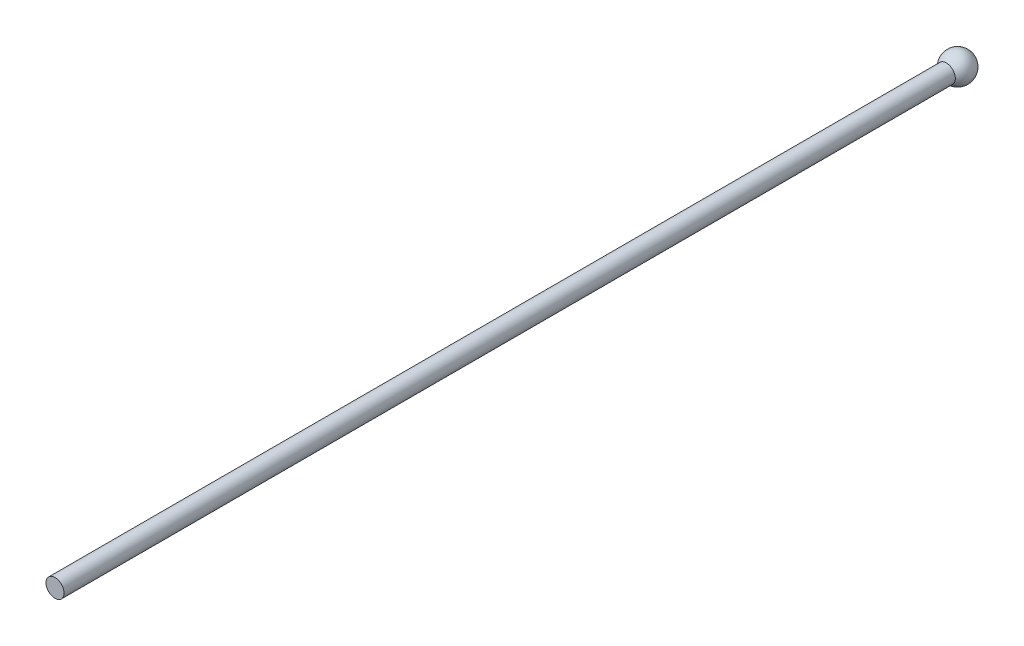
ISO-10303-21;
HEADER;
FILE_DESCRIPTION(('STEP AP214'),'2;1');
FILE_NAME('part.step','',(''),(''),'','','');
FILE_SCHEMA(('AUTOMOTIVE_DESIGN { 1 0 10303 214 1 1 1 1 }'));
ENDSEC;
DATA;
#1=APPLICATION_CONTEXT('core data for automotive mechanical design processes');
#2=APPLICATION_PROTOCOL_DEFINITION('international standard','automotive_design',2000,#1);
#3=PRODUCT_CONTEXT('',#1,'mechanical');
#4=PRODUCT('Part','Part','',(#3));
#5=PRODUCT_RELATED_PRODUCT_CATEGORY('part','',(#4));
#6=PRODUCT_DEFINITION_FORMATION('','',#4);
#7=PRODUCT_DEFINITION_CONTEXT('part definition',#1,'design');
#8=PRODUCT_DEFINITION('design','',#6,#7);
#9=PRODUCT_DEFINITION_SHAPE('','',#8);
#10=(LENGTH_UNIT() NAMED_UNIT(*) SI_UNIT(.MILLI.,.METRE.));
#11=(NAMED_UNIT(*) PLANE_ANGLE_UNIT() SI_UNIT($,.RADIAN.));
#12=(NAMED_UNIT(*) SI_UNIT($,.STERADIAN.) SOLID_ANGLE_UNIT());
#13=UNCERTAINTY_MEASURE_WITH_UNIT(LENGTH_MEASURE(1.E-05),#10,'distance_accuracy_value','');
#14=(GEOMETRIC_REPRESENTATION_CONTEXT(3) GLOBAL_UNCERTAINTY_ASSIGNED_CONTEXT((#13)) GLOBAL_UNIT_ASSIGNED_CONTEXT((#10,
#11,#12)) REPRESENTATION_CONTEXT('',''));
#15=CARTESIAN_POINT('',(0.,0.,0.));
#16=DIRECTION('',(0.,0.,1.));
#17=DIRECTION('',(1.,0.,0.));
#18=AXIS2_PLACEMENT_3D('',#15,#16,#17);
#19=CARTESIAN_POINT('',(0.,0.,250.));
#20=DIRECTION('',(0.,0.,-1.));
#21=DIRECTION('',(-1.,0.,0.));
#22=AXIS2_PLACEMENT_3D('',#19,#20,#21);
#23=CYLINDRICAL_SURFACE('',#22,2.5);
#24=CARTESIAN_POINT('',(0.,0.,250.));
#25=DIRECTION('',(0.,0.,1.));
#26=DIRECTION('',(1.,0.,0.));
#27=AXIS2_PLACEMENT_3D('',#24,#25,#26);
#28=CIRCLE('',#27,2.5);
#29=CARTESIAN_POINT('',(2.5,0.,250.));
#30=VERTEX_POINT('',#29);
#31=EDGE_CURVE('E35',#30,#30,#28,.T.);
#32=ORIENTED_EDGE('',*,*,#31,.F.);
#33=EDGE_LOOP('',(#32));
#34=FACE_BOUND('',#33,.T.);
#35=CARTESIAN_POINT('',(0.,0.,3.1224989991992));
#36=DIRECTION('',(0.,0.,-1.));
#37=DIRECTION('',(-1.,0.,0.));
#38=AXIS2_PLACEMENT_3D('',#35,#36,#37);
#39=CIRCLE('',#38,2.5);
#40=CARTESIAN_POINT('',(-2.5,0.,3.1224989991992));
#41=VERTEX_POINT('',#40);
#42=EDGE_CURVE('E10',#41,#41,#39,.T.);
#43=ORIENTED_EDGE('',*,*,#42,.F.);
#44=EDGE_LOOP('',(#43));
#45=FACE_BOUND('',#44,.T.);
#46=ADVANCED_FACE('F29',(#34,#45),#23,.T.);
#47=CARTESIAN_POINT('',(0.,0.,250.));
#48=DIRECTION('',(0.,0.,1.));
#49=DIRECTION('',(1.,0.,0.));
#50=AXIS2_PLACEMENT_3D('',#47,#48,#49);
#51=PLANE('',#50);
#52=ORIENTED_EDGE('',*,*,#31,.T.);
#53=EDGE_LOOP('',(#52));
#54=FACE_BOUND('',#53,.T.);
#55=ADVANCED_FACE('F41',(#54),#51,.T.);
#56=CARTESIAN_POINT('',(0.,0.,0.));
#57=DIRECTION('',(0.,0.,-1.));
#58=DIRECTION('',(1.,0.,0.));
#59=AXIS2_PLACEMENT_3D('',#56,#57,#58);
#60=SPHERICAL_SURFACE('',#59,4.);
#61=ORIENTED_EDGE('',*,*,#42,.T.);
#62=EDGE_LOOP('',(#61));
#63=FACE_BOUND('',#62,.T.);
#64=ADVANCED_FACE('F48',(#63),#60,.T.);
#65=CLOSED_SHELL('',(#46,#55,#64));
#66=MANIFOLD_SOLID_BREP('B2',#65);
#67=ADVANCED_BREP_SHAPE_REPRESENTATION('',(#18,#66),#14);
#68=SHAPE_DEFINITION_REPRESENTATION(#9,#67);
ENDSEC;
END-ISO-10303-21;
